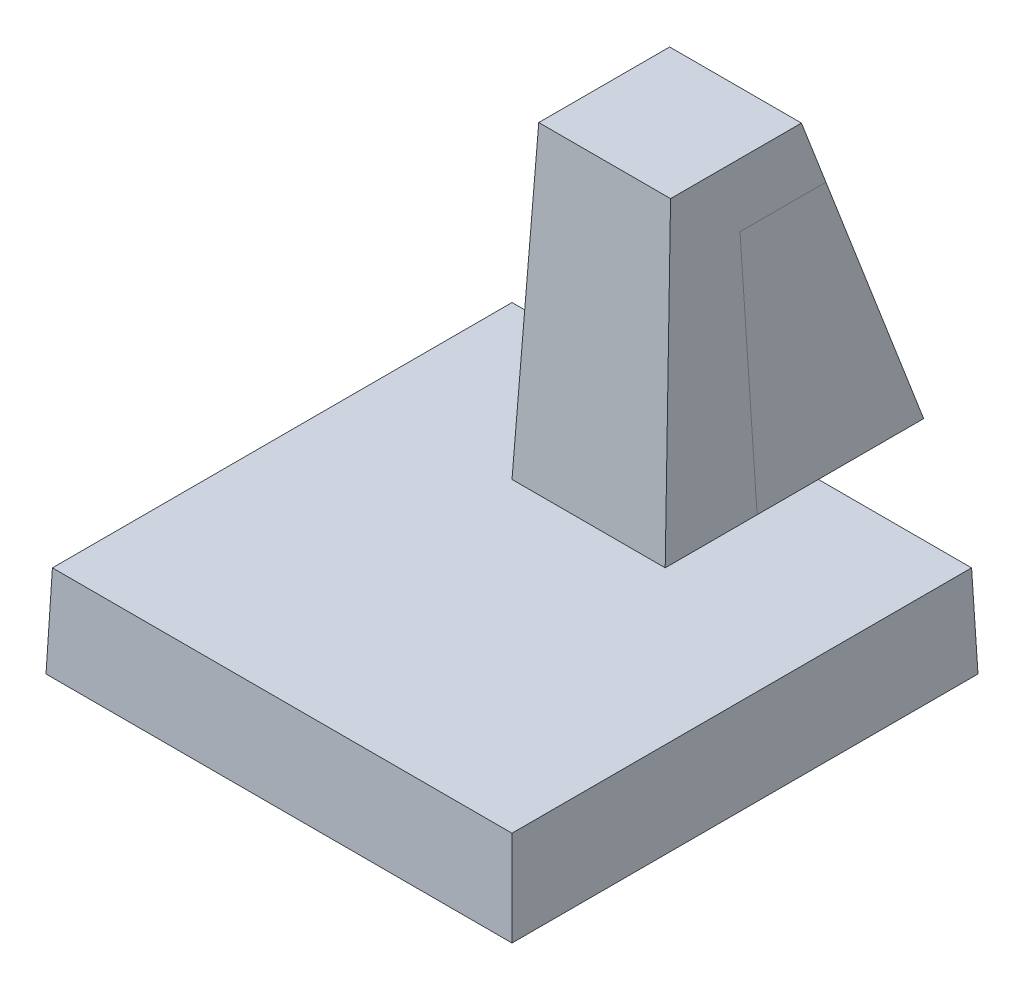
ISO-10303-21;
HEADER;
FILE_DESCRIPTION(('STEP AP214'),'2;1');
FILE_NAME('part.step','',(''),(''),'','','');
FILE_SCHEMA(('AUTOMOTIVE_DESIGN { 1 0 10303 214 1 1 1 1 }'));
ENDSEC;
DATA;
#1=APPLICATION_CONTEXT('core data for automotive mechanical design processes');
#2=APPLICATION_PROTOCOL_DEFINITION('international standard','automotive_design',2000,#1);
#3=PRODUCT_CONTEXT('',#1,'mechanical');
#4=PRODUCT('Part','Part','',(#3));
#5=PRODUCT_RELATED_PRODUCT_CATEGORY('part','',(#4));
#6=PRODUCT_DEFINITION_FORMATION('','',#4);
#7=PRODUCT_DEFINITION_CONTEXT('part definition',#1,'design');
#8=PRODUCT_DEFINITION('design','',#6,#7);
#9=PRODUCT_DEFINITION_SHAPE('','',#8);
#10=(LENGTH_UNIT() NAMED_UNIT(*) SI_UNIT(.MILLI.,.METRE.));
#11=(NAMED_UNIT(*) PLANE_ANGLE_UNIT() SI_UNIT($,.RADIAN.));
#12=(NAMED_UNIT(*) SI_UNIT($,.STERADIAN.) SOLID_ANGLE_UNIT());
#13=UNCERTAINTY_MEASURE_WITH_UNIT(LENGTH_MEASURE(1.E-05),#10,'distance_accuracy_value','');
#14=(GEOMETRIC_REPRESENTATION_CONTEXT(3) GLOBAL_UNCERTAINTY_ASSIGNED_CONTEXT((#13)) GLOBAL_UNIT_ASSIGNED_CONTEXT((#10,
#11,#12)) REPRESENTATION_CONTEXT('',''));
#15=CARTESIAN_POINT('',(0.,0.,0.));
#16=DIRECTION('',(0.,0.,1.));
#17=DIRECTION('',(1.,0.,0.));
#18=AXIS2_PLACEMENT_3D('',#15,#16,#17);
#19=CARTESIAN_POINT('',(2.5,0.,-3.));
#20=DIRECTION('',(0.,1.,0.));
#21=DIRECTION('',(0.,0.,1.));
#22=AXIS2_PLACEMENT_3D('',#19,#20,#21);
#23=PLANE('',#22);
#24=DIRECTION('',(0.,0.,1.));
#25=VECTOR('',#24,1.);
#26=CARTESIAN_POINT('',(-2.5,0.,-3.));
#27=LINE('',#26,#25);
#28=CARTESIAN_POINT('',(-2.5,0.,-3.));
#29=VERTEX_POINT('',#28);
#30=CARTESIAN_POINT('',(-2.5,0.,-8.4358396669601));
#31=VERTEX_POINT('',#30);
#32=EDGE_CURVE('E98',#29,#31,#27,.F.);
#33=ORIENTED_EDGE('',*,*,#32,.T.);
#34=DIRECTION('',(-1.,0.,0.));
#35=VECTOR('',#34,1.);
#36=CARTESIAN_POINT('',(2.5,0.,-8.4358396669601));
#37=LINE('',#36,#35);
#38=CARTESIAN_POINT('',(2.5,0.,-8.4358396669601));
#39=VERTEX_POINT('',#38);
#40=EDGE_CURVE('E12',#39,#31,#37,.T.);
#41=ORIENTED_EDGE('',*,*,#40,.F.);
#42=DIRECTION('',(0.,0.,-1.));
#43=VECTOR('',#42,1.);
#44=CARTESIAN_POINT('',(2.5,0.,-3.));
#45=LINE('',#44,#43);
#46=CARTESIAN_POINT('',(2.5,0.,-3.));
#47=VERTEX_POINT('',#46);
#48=EDGE_CURVE('E109',#47,#39,#45,.T.);
#49=ORIENTED_EDGE('',*,*,#48,.F.);
#50=DIRECTION('',(-1.,0.,0.));
#51=VECTOR('',#50,1.);
#52=CARTESIAN_POINT('',(2.5,0.,-3.));
#53=LINE('',#52,#51);
#54=EDGE_CURVE('E64',#47,#29,#53,.T.);
#55=ORIENTED_EDGE('',*,*,#54,.T.);
#56=EDGE_LOOP('',(#33,#41,#49,#55));
#57=FACE_BOUND('',#56,.T.);
#58=ADVANCED_FACE('F45',(#57),#23,.F.);
#59=CARTESIAN_POINT('',(2.5,0.,-8.4358396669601));
#60=DIRECTION('',(0.,-0.342020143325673,0.939692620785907));
#61=DIRECTION('',(0.,-0.939692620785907,-0.342020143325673));
#62=AXIS2_PLACEMENT_3D('',#59,#60,#61);
#63=PLANE('',#62);
#64=DIRECTION('',(-0.0327971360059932,-0.939187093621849,-0.341836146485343));
#65=VECTOR('',#64,1.);
#66=CARTESIAN_POINT('',(-2.49462173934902,0.154013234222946,-8.37978343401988));
#67=LINE('',#66,#65);
#68=CARTESIAN_POINT('',(-2.22063384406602,8.,-5.52407779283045));
#69=VERTEX_POINT('',#68);
#70=EDGE_CURVE('E95',#31,#69,#67,.F.);
#71=ORIENTED_EDGE('',*,*,#70,.T.);
#72=DIRECTION('',(-1.,0.,0.));
#73=VECTOR('',#72,1.);
#74=CARTESIAN_POINT('',(2.5,8.,-5.52407779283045));
#75=LINE('',#74,#73);
#76=CARTESIAN_POINT('',(2.22063384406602,8.,-5.52407779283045));
#77=VERTEX_POINT('',#76);
#78=EDGE_CURVE('E55',#77,#69,#75,.T.);
#79=ORIENTED_EDGE('',*,*,#78,.F.);
#80=DIRECTION('',(-0.0327971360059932,0.939187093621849,0.341836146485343));
#81=VECTOR('',#80,1.);
#82=CARTESIAN_POINT('',(2.5,0.,-8.4358396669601));
#83=LINE('',#82,#81);
#84=EDGE_CURVE('E49',#39,#77,#83,.T.);
#85=ORIENTED_EDGE('',*,*,#84,.F.);
#86=ORIENTED_EDGE('',*,*,#40,.T.);
#87=EDGE_LOOP('',(#71,#79,#85,#86));
#88=FACE_BOUND('',#87,.T.);
#89=ADVANCED_FACE('F102',(#88),#63,.F.);
#90=CARTESIAN_POINT('',(2.5,8.,-2.72063384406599));
#91=DIRECTION('',(0.,1.,0.));
#92=DIRECTION('',(0.,0.,1.));
#93=AXIS2_PLACEMENT_3D('',#90,#91,#92);
#94=PLANE('',#93);
#95=DIRECTION('',(0.,0.,1.));
#96=VECTOR('',#95,1.);
#97=CARTESIAN_POINT('',(-2.22063384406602,8.,-2.72063384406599));
#98=LINE('',#97,#96);
#99=CARTESIAN_POINT('',(-2.22063384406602,8.,-2.72063384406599));
#100=VERTEX_POINT('',#99);
#101=EDGE_CURVE('E99',#100,#69,#98,.F.);
#102=ORIENTED_EDGE('',*,*,#101,.F.);
#103=DIRECTION('',(-1.,0.,0.));
#104=VECTOR('',#103,1.);
#105=CARTESIAN_POINT('',(2.5,8.,-2.72063384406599));
#106=LINE('',#105,#104);
#107=CARTESIAN_POINT('',(2.22063384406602,8.,-2.72063384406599));
#108=VERTEX_POINT('',#107);
#109=EDGE_CURVE('E85',#108,#100,#106,.T.);
#110=ORIENTED_EDGE('',*,*,#109,.F.);
#111=DIRECTION('',(0.,0.,-1.));
#112=VECTOR('',#111,1.);
#113=CARTESIAN_POINT('',(2.22063384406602,8.,-2.72063384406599));
#114=LINE('',#113,#112);
#115=EDGE_CURVE('E112',#108,#77,#114,.T.);
#116=ORIENTED_EDGE('',*,*,#115,.T.);
#117=ORIENTED_EDGE('',*,*,#78,.T.);
#118=EDGE_LOOP('',(#102,#110,#116,#117));
#119=FACE_BOUND('',#118,.T.);
#120=ADVANCED_FACE('F115',(#119),#94,.T.);
#121=CARTESIAN_POINT('',(2.5,0.,-3.));
#122=DIRECTION('',(0.,-0.0348994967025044,0.999390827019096));
#123=DIRECTION('',(0.,-0.999390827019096,-0.0348994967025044));
#124=AXIS2_PLACEMENT_3D('',#121,#122,#123);
#125=PLANE('',#124);
#126=DIRECTION('',(-0.0348782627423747,-0.998782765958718,-0.0348782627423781));
#127=VECTOR('',#126,1.);
#128=CARTESIAN_POINT('',(-2.49391753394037,0.17417903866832,-2.99391753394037));
#129=LINE('',#128,#127);
#130=EDGE_CURVE('E107',#29,#100,#129,.F.);
#131=ORIENTED_EDGE('',*,*,#130,.F.);
#132=ORIENTED_EDGE('',*,*,#54,.F.);
#133=DIRECTION('',(-0.0348782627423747,0.998782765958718,0.0348782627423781));
#134=VECTOR('',#133,1.);
#135=CARTESIAN_POINT('',(2.5,0.,-3.));
#136=LINE('',#135,#134);
#137=EDGE_CURVE('E111',#47,#108,#136,.T.);
#138=ORIENTED_EDGE('',*,*,#137,.T.);
#139=ORIENTED_EDGE('',*,*,#109,.T.);
#140=EDGE_LOOP('',(#131,#132,#138,#139));
#141=FACE_BOUND('',#140,.T.);
#142=ADVANCED_FACE('F117',(#141),#125,.T.);
#143=CARTESIAN_POINT('',(2.5,0.,0.));
#144=DIRECTION('',(0.999390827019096,0.034899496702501,0.));
#145=DIRECTION('',(-0.034899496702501,0.999390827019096,0.));
#146=AXIS2_PLACEMENT_3D('',#143,#144,#145);
#147=PLANE('',#146);
#148=ORIENTED_EDGE('',*,*,#48,.T.);
#149=ORIENTED_EDGE('',*,*,#84,.T.);
#150=ORIENTED_EDGE('',*,*,#115,.F.);
#151=ORIENTED_EDGE('',*,*,#137,.F.);
#152=EDGE_LOOP('',(#148,#149,#150,#151));
#153=FACE_BOUND('',#152,.T.);
#154=ADVANCED_FACE('F47',(#153),#147,.T.);
#155=CARTESIAN_POINT('',(-2.5,0.,0.));
#156=DIRECTION('',(-0.999390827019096,0.034899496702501,0.));
#157=DIRECTION('',(-0.034899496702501,-0.999390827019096,0.));
#158=AXIS2_PLACEMENT_3D('',#155,#156,#157);
#159=PLANE('',#158);
#160=ORIENTED_EDGE('',*,*,#32,.F.);
#161=ORIENTED_EDGE('',*,*,#130,.T.);
#162=ORIENTED_EDGE('',*,*,#101,.T.);
#163=ORIENTED_EDGE('',*,*,#70,.F.);
#164=EDGE_LOOP('',(#160,#161,#162,#163));
#165=FACE_BOUND('',#164,.T.);
#166=ADVANCED_FACE('F96',(#165),#159,.T.);
#167=CLOSED_SHELL('',(#58,#89,#120,#142,#154,#166));
#168=MANIFOLD_SOLID_BREP('B2_NOT_SHOWN',#167);
#169=CARTESIAN_POINT('',(2.5,8.,-2.72063384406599));
#170=DIRECTION('',(0.,-0.0348994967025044,0.999390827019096));
#171=DIRECTION('',(0.,-0.999390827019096,-0.0348994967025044));
#172=AXIS2_PLACEMENT_3D('',#169,#170,#171);
#173=PLANE('',#172);
#174=DIRECTION('',(-0.0348782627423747,-0.998782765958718,-0.0348782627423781));
#175=VECTOR('',#174,1.);
#176=CARTESIAN_POINT('',(-2.21489122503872,8.16444709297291,-2.71489122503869));
#177=LINE('',#176,#175);
#178=CARTESIAN_POINT('',(-2.5,0.,-3.));
#179=VERTEX_POINT('',#178);
#180=CARTESIAN_POINT('',(-2.22063384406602,8.,-2.72063384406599));
#181=VERTEX_POINT('',#180);
#182=EDGE_CURVE('E239',#179,#181,#177,.F.);
#183=ORIENTED_EDGE('',*,*,#182,.T.);
#184=DIRECTION('',(-1.,0.,0.));
#185=VECTOR('',#184,1.);
#186=CARTESIAN_POINT('',(2.5,8.,-2.72063384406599));
#187=LINE('',#186,#185);
#188=CARTESIAN_POINT('',(2.22063384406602,8.,-2.72063384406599));
#189=VERTEX_POINT('',#188);
#190=EDGE_CURVE('E179',#189,#181,#187,.T.);
#191=ORIENTED_EDGE('',*,*,#190,.F.);
#192=DIRECTION('',(-0.0348782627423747,0.998782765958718,0.0348782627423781));
#193=VECTOR('',#192,1.);
#194=CARTESIAN_POINT('',(2.22097369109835,7.99026805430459,-2.72097369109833));
#195=LINE('',#194,#193);
#196=CARTESIAN_POINT('',(2.5,0.,-3.));
#197=VERTEX_POINT('',#196);
#198=EDGE_CURVE('E173',#197,#189,#195,.T.);
#199=ORIENTED_EDGE('',*,*,#198,.F.);
#200=DIRECTION('',(-1.,0.,0.));
#201=VECTOR('',#200,1.);
#202=CARTESIAN_POINT('',(2.5,0.,-3.));
#203=LINE('',#202,#201);
#204=EDGE_CURVE('E43',#197,#179,#203,.T.);
#205=ORIENTED_EDGE('',*,*,#204,.T.);
#206=EDGE_LOOP('',(#183,#191,#199,#205));
#207=FACE_BOUND('',#206,.T.);
#208=ADVANCED_FACE('F169',(#207),#173,.F.);
#209=CARTESIAN_POINT('',(2.5,8.,-5.52407779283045));
#210=DIRECTION('',(0.,1.,0.));
#211=DIRECTION('',(0.,0.,1.));
#212=AXIS2_PLACEMENT_3D('',#209,#210,#211);
#213=PLANE('',#212);
#214=DIRECTION('',(0.,0.,1.));
#215=VECTOR('',#214,1.);
#216=CARTESIAN_POINT('',(-2.22063384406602,8.,-5.52407779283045));
#217=LINE('',#216,#215);
#218=CARTESIAN_POINT('',(-2.22063384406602,8.,-5.52407779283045));
#219=VERTEX_POINT('',#218);
#220=EDGE_CURVE('E242',#181,#219,#217,.F.);
#221=ORIENTED_EDGE('',*,*,#220,.T.);
#222=DIRECTION('',(-1.,0.,0.));
#223=VECTOR('',#222,1.);
#224=CARTESIAN_POINT('',(2.5,8.,-5.52407779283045));
#225=LINE('',#224,#223);
#226=CARTESIAN_POINT('',(2.22063384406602,8.,-5.52407779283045));
#227=VERTEX_POINT('',#226);
#228=EDGE_CURVE('E256',#227,#219,#225,.T.);
#229=ORIENTED_EDGE('',*,*,#228,.F.);
#230=DIRECTION('',(0.,0.,-1.));
#231=VECTOR('',#230,1.);
#232=CARTESIAN_POINT('',(2.22063384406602,8.,-5.52407779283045));
#233=LINE('',#232,#231);
#234=EDGE_CURVE('E217',#189,#227,#233,.T.);
#235=ORIENTED_EDGE('',*,*,#234,.F.);
#236=ORIENTED_EDGE('',*,*,#190,.T.);
#237=EDGE_LOOP('',(#221,#229,#235,#236));
#238=FACE_BOUND('',#237,.T.);
#239=ADVANCED_FACE('F286',(#238),#213,.F.);
#240=CARTESIAN_POINT('',(2.5,10.,-4.79613732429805));
#241=DIRECTION('',(0.,-0.342020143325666,0.939692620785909));
#242=DIRECTION('',(0.,-0.93969262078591,-0.342020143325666));
#243=AXIS2_PLACEMENT_3D('',#240,#241,#242);
#244=PLANE('',#243);
#245=DIRECTION('',(-0.0327971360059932,-0.939187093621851,-0.341836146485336));
#246=VECTOR('',#245,1.);
#247=CARTESIAN_POINT('',(-2.14578967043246,10.143256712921,-4.74399614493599));
#248=LINE('',#247,#246);
#249=CARTESIAN_POINT('',(-2.15079230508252,10.,-4.79613732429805));
#250=VERTEX_POINT('',#249);
#251=EDGE_CURVE('E261',#219,#250,#248,.F.);
#252=ORIENTED_EDGE('',*,*,#251,.T.);
#253=DIRECTION('',(-1.,0.,0.));
#254=VECTOR('',#253,1.);
#255=CARTESIAN_POINT('',(2.5,10.,-4.79613732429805));
#256=LINE('',#255,#254);
#257=CARTESIAN_POINT('',(2.15079230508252,10.,-4.79613732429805));
#258=VERTEX_POINT('',#257);
#259=EDGE_CURVE('E253',#258,#250,#256,.T.);
#260=ORIENTED_EDGE('',*,*,#259,.F.);
#261=DIRECTION('',(-0.0327971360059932,0.939187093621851,0.341836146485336));
#262=VECTOR('',#261,1.);
#263=CARTESIAN_POINT('',(2.15116793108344,9.98924347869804,-4.80005237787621));
#264=LINE('',#263,#262);
#265=EDGE_CURVE('E269',#227,#258,#264,.T.);
#266=ORIENTED_EDGE('',*,*,#265,.F.);
#267=ORIENTED_EDGE('',*,*,#228,.T.);
#268=EDGE_LOOP('',(#252,#260,#266,#267));
#269=FACE_BOUND('',#268,.T.);
#270=ADVANCED_FACE('F275',(#269),#244,.F.);
#271=CARTESIAN_POINT('',(2.5,10.,-0.524077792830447));
#272=DIRECTION('',(0.,-1.,0.));
#273=DIRECTION('',(0.,0.,-1.));
#274=AXIS2_PLACEMENT_3D('',#271,#272,#273);
#275=PLANE('',#274);
#276=DIRECTION('',(0.,0.,-1.));
#277=VECTOR('',#276,1.);
#278=CARTESIAN_POINT('',(-2.15079230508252,10.,-0.524077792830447));
#279=LINE('',#278,#277);
#280=CARTESIAN_POINT('',(-2.15079230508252,10.,-0.524077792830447));
#281=VERTEX_POINT('',#280);
#282=EDGE_CURVE('E263',#250,#281,#279,.F.);
#283=ORIENTED_EDGE('',*,*,#282,.T.);
#284=DIRECTION('',(-1.,0.,0.));
#285=VECTOR('',#284,1.);
#286=CARTESIAN_POINT('',(2.5,10.,-0.524077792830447));
#287=LINE('',#286,#285);
#288=CARTESIAN_POINT('',(2.15079230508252,10.,-0.524077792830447));
#289=VERTEX_POINT('',#288);
#290=EDGE_CURVE('E250',#289,#281,#287,.T.);
#291=ORIENTED_EDGE('',*,*,#290,.F.);
#292=DIRECTION('',(0.,0.,1.));
#293=VECTOR('',#292,1.);
#294=CARTESIAN_POINT('',(2.15079230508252,10.,-0.524077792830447));
#295=LINE('',#294,#293);
#296=EDGE_CURVE('E267',#258,#289,#295,.T.);
#297=ORIENTED_EDGE('',*,*,#296,.F.);
#298=ORIENTED_EDGE('',*,*,#259,.T.);
#299=EDGE_LOOP('',(#283,#291,#297,#298));
#300=FACE_BOUND('',#299,.T.);
#301=ADVANCED_FACE('F279',(#300),#275,.F.);
#302=CARTESIAN_POINT('',(2.5,0.,0.));
#303=DIRECTION('',(0.,-0.0523359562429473,-0.998629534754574));
#304=DIRECTION('',(0.,0.998629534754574,-0.0523359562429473));
#305=AXIS2_PLACEMENT_3D('',#302,#303,#304);
#306=PLANE('',#305);
#307=DIRECTION('',(0.0348517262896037,0.998022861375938,-0.0523041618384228));
#308=VECTOR('',#307,1.);
#309=CARTESIAN_POINT('',(-2.49392678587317,0.173914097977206,-0.00911445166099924));
#310=LINE('',#309,#308);
#311=CARTESIAN_POINT('',(-2.5,0.,0.));
#312=VERTEX_POINT('',#311);
#313=EDGE_CURVE('E229',#281,#312,#310,.F.);
#314=ORIENTED_EDGE('',*,*,#313,.T.);
#315=DIRECTION('',(-1.,0.,0.));
#316=VECTOR('',#315,1.);
#317=CARTESIAN_POINT('',(2.5,0.,0.));
#318=LINE('',#317,#316);
#319=CARTESIAN_POINT('',(2.5,0.,0.));
#320=VERTEX_POINT('',#319);
#321=EDGE_CURVE('E235',#320,#312,#318,.T.);
#322=ORIENTED_EDGE('',*,*,#321,.F.);
#323=DIRECTION('',(0.0348517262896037,-0.998022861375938,0.0523041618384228));
#324=VECTOR('',#323,1.);
#325=CARTESIAN_POINT('',(2.5,0.,0.));
#326=LINE('',#325,#324);
#327=EDGE_CURVE('E188',#289,#320,#326,.T.);
#328=ORIENTED_EDGE('',*,*,#327,.F.);
#329=ORIENTED_EDGE('',*,*,#290,.T.);
#330=EDGE_LOOP('',(#314,#322,#328,#329));
#331=FACE_BOUND('',#330,.T.);
#332=ADVANCED_FACE('F281',(#331),#306,.F.);
#333=CARTESIAN_POINT('',(2.5,0.,-3.));
#334=DIRECTION('',(0.999390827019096,0.034899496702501,0.));
#335=DIRECTION('',(-0.034899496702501,0.999390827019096,0.));
#336=AXIS2_PLACEMENT_3D('',#333,#334,#335);
#337=PLANE('',#336);
#338=DIRECTION('',(0.,0.,-1.));
#339=VECTOR('',#338,1.);
#340=CARTESIAN_POINT('',(2.5,0.,-3.));
#341=LINE('',#340,#339);
#342=EDGE_CURVE('E225',#320,#197,#341,.T.);
#343=ORIENTED_EDGE('',*,*,#342,.T.);
#344=ORIENTED_EDGE('',*,*,#198,.T.);
#345=ORIENTED_EDGE('',*,*,#234,.T.);
#346=ORIENTED_EDGE('',*,*,#265,.T.);
#347=ORIENTED_EDGE('',*,*,#296,.T.);
#348=ORIENTED_EDGE('',*,*,#327,.T.);
#349=EDGE_LOOP('',(#343,#344,#345,#346,#347,#348));
#350=FACE_BOUND('',#349,.T.);
#351=ADVANCED_FACE('F171',(#350),#337,.T.);
#352=CARTESIAN_POINT('',(-2.5,0.,-3.));
#353=DIRECTION('',(-0.999390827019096,0.034899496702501,0.));
#354=DIRECTION('',(-0.034899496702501,-0.999390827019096,0.));
#355=AXIS2_PLACEMENT_3D('',#352,#353,#354);
#356=PLANE('',#355);
#357=DIRECTION('',(0.,0.,-1.));
#358=VECTOR('',#357,1.);
#359=CARTESIAN_POINT('',(-2.5,0.,-3.));
#360=LINE('',#359,#358);
#361=EDGE_CURVE('E234',#312,#179,#360,.T.);
#362=ORIENTED_EDGE('',*,*,#361,.F.);
#363=ORIENTED_EDGE('',*,*,#313,.F.);
#364=ORIENTED_EDGE('',*,*,#282,.F.);
#365=ORIENTED_EDGE('',*,*,#251,.F.);
#366=ORIENTED_EDGE('',*,*,#220,.F.);
#367=ORIENTED_EDGE('',*,*,#182,.F.);
#368=EDGE_LOOP('',(#362,#363,#364,#365,#366,#367));
#369=FACE_BOUND('',#368,.T.);
#370=ADVANCED_FACE('F283',(#369),#356,.T.);
#371=CARTESIAN_POINT('',(-7.5,0.,-5.));
#372=DIRECTION('',(-0.999390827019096,0.034899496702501,0.));
#373=DIRECTION('',(-0.034899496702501,-0.999390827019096,0.));
#374=AXIS2_PLACEMENT_3D('',#371,#372,#373);
#375=PLANE('',#374);
#376=DIRECTION('',(0.,0.,1.));
#377=VECTOR('',#376,1.);
#378=CARTESIAN_POINT('',(-7.5,0.,-5.));
#379=LINE('',#378,#377);
#380=CARTESIAN_POINT('',(-7.5,0.,-5.));
#381=VERTEX_POINT('',#380);
#382=CARTESIAN_POINT('',(-7.5,0.,10.));
#383=VERTEX_POINT('',#382);
#384=EDGE_CURVE('E378',#381,#383,#379,.T.);
#385=ORIENTED_EDGE('',*,*,#384,.F.);
#386=DIRECTION('',(0.0348782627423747,0.998782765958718,0.0348782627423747));
#387=VECTOR('',#386,1.);
#388=CARTESIAN_POINT('',(-7.5,0.,-5.));
#389=LINE('',#388,#387);
#390=CARTESIAN_POINT('',(-7.60476230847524,-3.,-5.10476230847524));
#391=VERTEX_POINT('',#390);
#392=EDGE_CURVE('E240',#391,#381,#389,.T.);
#393=ORIENTED_EDGE('',*,*,#392,.F.);
#394=DIRECTION('',(0.,0.,1.));
#395=VECTOR('',#394,1.);
#396=CARTESIAN_POINT('',(-7.60476230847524,-3.,0.));
#397=LINE('',#396,#395);
#398=CARTESIAN_POINT('',(-7.60476230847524,-3.,10.1047623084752));
#399=VERTEX_POINT('',#398);
#400=EDGE_CURVE('E335',#391,#399,#397,.T.);
#401=ORIENTED_EDGE('',*,*,#400,.T.);
#402=DIRECTION('',(0.0348782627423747,0.998782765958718,-0.0348782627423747));
#403=VECTOR('',#402,1.);
#404=CARTESIAN_POINT('',(-7.48175260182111,0.522537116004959,9.98175260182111));
#405=LINE('',#404,#403);
#406=EDGE_CURVE('E354',#399,#383,#405,.T.);
#407=ORIENTED_EDGE('',*,*,#406,.T.);
#408=EDGE_LOOP('',(#385,#393,#401,#407));
#409=FACE_BOUND('',#408,.T.);
#410=ADVANCED_FACE('F297',(#409),#375,.T.);
#411=CARTESIAN_POINT('',(-7.5,0.,-5.));
#412=DIRECTION('',(0.,0.034899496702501,-0.999390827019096));
#413=DIRECTION('',(0.,0.999390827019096,0.034899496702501));
#414=AXIS2_PLACEMENT_3D('',#411,#412,#413);
#415=PLANE('',#414);
#416=DIRECTION('',(-1.,0.,0.));
#417=VECTOR('',#416,1.);
#418=CARTESIAN_POINT('',(-7.5,0.,-5.));
#419=LINE('',#418,#417);
#420=CARTESIAN_POINT('',(7.5,0.,-5.));
#421=VERTEX_POINT('',#420);
#422=EDGE_CURVE('E346',#421,#381,#419,.T.);
#423=ORIENTED_EDGE('',*,*,#422,.F.);
#424=DIRECTION('',(-0.0348782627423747,0.998782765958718,0.0348782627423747));
#425=VECTOR('',#424,1.);
#426=CARTESIAN_POINT('',(7.5,0.,-5.));
#427=LINE('',#426,#425);
#428=CARTESIAN_POINT('',(7.60476230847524,-3.,-5.10476230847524));
#429=VERTEX_POINT('',#428);
#430=EDGE_CURVE('E245',#429,#421,#427,.T.);
#431=ORIENTED_EDGE('',*,*,#430,.F.);
#432=DIRECTION('',(-1.,0.,0.));
#433=VECTOR('',#432,1.);
#434=CARTESIAN_POINT('',(0.,-3.,-5.10476230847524));
#435=LINE('',#434,#433);
#436=EDGE_CURVE('E339',#429,#391,#435,.T.);
#437=ORIENTED_EDGE('',*,*,#436,.T.);
#438=ORIENTED_EDGE('',*,*,#392,.T.);
#439=EDGE_LOOP('',(#423,#431,#437,#438));
#440=FACE_BOUND('',#439,.T.);
#441=ADVANCED_FACE('F302',(#440),#415,.T.);
#442=CARTESIAN_POINT('',(7.5,0.,-5.));
#443=DIRECTION('',(0.999390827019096,0.034899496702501,0.));
#444=DIRECTION('',(-0.034899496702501,0.999390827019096,0.));
#445=AXIS2_PLACEMENT_3D('',#442,#443,#444);
#446=PLANE('',#445);
#447=DIRECTION('',(0.,0.,-1.));
#448=VECTOR('',#447,1.);
#449=CARTESIAN_POINT('',(7.5,0.,-5.));
#450=LINE('',#449,#448);
#451=CARTESIAN_POINT('',(7.5,0.,10.));
#452=VERTEX_POINT('',#451);
#453=EDGE_CURVE('E383',#452,#421,#450,.T.);
#454=ORIENTED_EDGE('',*,*,#453,.F.);
#455=DIRECTION('',(-0.0348782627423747,0.998782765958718,-0.0348782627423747));
#456=VECTOR('',#455,1.);
#457=CARTESIAN_POINT('',(7.48175260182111,0.522537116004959,9.98175260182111));
#458=LINE('',#457,#456);
#459=CARTESIAN_POINT('',(7.60476230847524,-3.,10.1047623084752));
#460=VERTEX_POINT('',#459);
#461=EDGE_CURVE('E357',#460,#452,#458,.T.);
#462=ORIENTED_EDGE('',*,*,#461,.F.);
#463=DIRECTION('',(0.,0.,-1.));
#464=VECTOR('',#463,1.);
#465=CARTESIAN_POINT('',(7.60476230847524,-3.,0.));
#466=LINE('',#465,#464);
#467=EDGE_CURVE('E355',#460,#429,#466,.T.);
#468=ORIENTED_EDGE('',*,*,#467,.T.);
#469=ORIENTED_EDGE('',*,*,#430,.T.);
#470=EDGE_LOOP('',(#454,#462,#468,#469));
#471=FACE_BOUND('',#470,.T.);
#472=ADVANCED_FACE('F315',(#471),#446,.T.);
#473=CARTESIAN_POINT('',(-7.5,0.,10.));
#474=DIRECTION('',(0.,0.034899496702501,0.999390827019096));
#475=DIRECTION('',(0.,-0.999390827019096,0.034899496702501));
#476=AXIS2_PLACEMENT_3D('',#473,#474,#475);
#477=PLANE('',#476);
#478=DIRECTION('',(1.,0.,0.));
#479=VECTOR('',#478,1.);
#480=CARTESIAN_POINT('',(-7.5,0.,10.));
#481=LINE('',#480,#479);
#482=EDGE_CURVE('E381',#383,#452,#481,.T.);
#483=ORIENTED_EDGE('',*,*,#482,.F.);
#484=ORIENTED_EDGE('',*,*,#406,.F.);
#485=DIRECTION('',(1.,0.,0.));
#486=VECTOR('',#485,1.);
#487=CARTESIAN_POINT('',(0.,-3.,10.1047623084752));
#488=LINE('',#487,#486);
#489=EDGE_CURVE('E342',#399,#460,#488,.T.);
#490=ORIENTED_EDGE('',*,*,#489,.T.);
#491=ORIENTED_EDGE('',*,*,#461,.T.);
#492=EDGE_LOOP('',(#483,#484,#490,#491));
#493=FACE_BOUND('',#492,.T.);
#494=ADVANCED_FACE('F319',(#493),#477,.T.);
#495=CARTESIAN_POINT('',(0.,-3.,0.));
#496=DIRECTION('',(0.,1.,0.));
#497=DIRECTION('',(0.,0.,1.));
#498=AXIS2_PLACEMENT_3D('',#495,#496,#497);
#499=PLANE('',#498);
#500=ORIENTED_EDGE('',*,*,#400,.F.);
#501=ORIENTED_EDGE('',*,*,#436,.F.);
#502=ORIENTED_EDGE('',*,*,#467,.F.);
#503=ORIENTED_EDGE('',*,*,#489,.F.);
#504=EDGE_LOOP('',(#500,#501,#502,#503));
#505=FACE_BOUND('',#504,.T.);
#506=ADVANCED_FACE('F322',(#505),#499,.F.);
#507=CARTESIAN_POINT('',(0.,0.,0.));
#508=DIRECTION('',(0.,1.,0.));
#509=DIRECTION('',(0.,0.,1.));
#510=AXIS2_PLACEMENT_3D('',#507,#508,#509);
#511=PLANE('',#510);
#512=ORIENTED_EDGE('',*,*,#321,.T.);
#513=ORIENTED_EDGE('',*,*,#361,.T.);
#514=ORIENTED_EDGE('',*,*,#204,.F.);
#515=ORIENTED_EDGE('',*,*,#342,.F.);
#516=EDGE_LOOP('',(#512,#513,#514,#515));
#517=FACE_BOUND('',#516,.T.);
#518=ORIENTED_EDGE('',*,*,#384,.T.);
#519=ORIENTED_EDGE('',*,*,#482,.T.);
#520=ORIENTED_EDGE('',*,*,#453,.T.);
#521=ORIENTED_EDGE('',*,*,#422,.T.);
#522=EDGE_LOOP('',(#518,#519,#520,#521));
#523=FACE_BOUND('',#522,.T.);
#524=ADVANCED_FACE('F231',(#517,#523),#511,.T.);
#525=CLOSED_SHELL('',(#208,#239,#270,#301,#332,#351,#370,#410,#441,#472,#494,#506,#524));
#526=MANIFOLD_SOLID_BREP('B6',#525);
#527=ADVANCED_BREP_SHAPE_REPRESENTATION('',(#18,#168,#526),#14);
#528=SHAPE_DEFINITION_REPRESENTATION(#9,#527);
ENDSEC;
END-ISO-10303-21;
